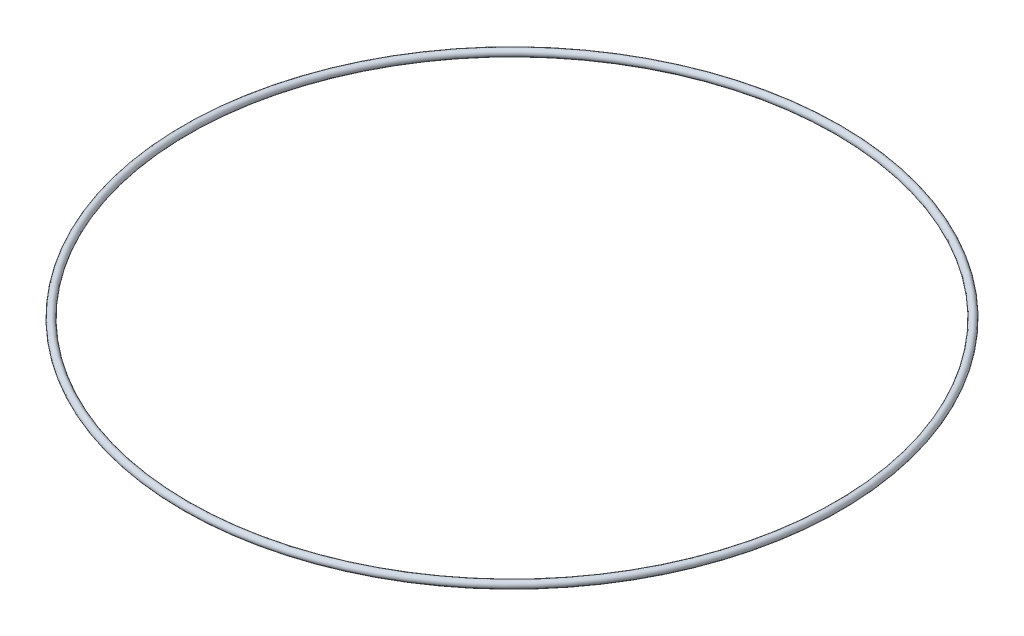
ISO-10303-21;
HEADER;
FILE_DESCRIPTION(('STEP AP214'),'2;1');
FILE_NAME('part.step','',(''),(''),'','','');
FILE_SCHEMA(('AUTOMOTIVE_DESIGN { 1 0 10303 214 1 1 1 1 }'));
ENDSEC;
DATA;
#1=APPLICATION_CONTEXT('core data for automotive mechanical design processes');
#2=APPLICATION_PROTOCOL_DEFINITION('international standard','automotive_design',2000,#1);
#3=PRODUCT_CONTEXT('',#1,'mechanical');
#4=PRODUCT('Part','Part','',(#3));
#5=PRODUCT_RELATED_PRODUCT_CATEGORY('part','',(#4));
#6=PRODUCT_DEFINITION_FORMATION('','',#4);
#7=PRODUCT_DEFINITION_CONTEXT('part definition',#1,'design');
#8=PRODUCT_DEFINITION('design','',#6,#7);
#9=PRODUCT_DEFINITION_SHAPE('','',#8);
#10=(LENGTH_UNIT() NAMED_UNIT(*) SI_UNIT(.MILLI.,.METRE.));
#11=(NAMED_UNIT(*) PLANE_ANGLE_UNIT() SI_UNIT($,.RADIAN.));
#12=(NAMED_UNIT(*) SI_UNIT($,.STERADIAN.) SOLID_ANGLE_UNIT());
#13=UNCERTAINTY_MEASURE_WITH_UNIT(LENGTH_MEASURE(1.E-05),#10,'distance_accuracy_value','');
#14=(GEOMETRIC_REPRESENTATION_CONTEXT(3) GLOBAL_UNCERTAINTY_ASSIGNED_CONTEXT((#13)) GLOBAL_UNIT_ASSIGNED_CONTEXT((#10,
#11,#12)) REPRESENTATION_CONTEXT('',''));
#15=CARTESIAN_POINT('',(0.,0.,0.));
#16=DIRECTION('',(0.,0.,1.));
#17=DIRECTION('',(1.,0.,0.));
#18=AXIS2_PLACEMENT_3D('',#15,#16,#17);
#19=CARTESIAN_POINT('',(0.,0.,0.));
#20=DIRECTION('',(0.,1.,0.));
#21=DIRECTION('',(0.,0.,1.));
#22=AXIS2_PLACEMENT_3D('',#19,#20,#21);
#23=TOROIDAL_SURFACE('',#22,136.5,1.5);
#24=CARTESIAN_POINT('',(0.,0.,138.));
#25=VERTEX_POINT('',#24);
#26=VERTEX_LOOP('',#25);
#27=FACE_BOUND('',#26,.T.);
#28=ADVANCED_FACE('F29',(#27),#23,.T.);
#29=CLOSED_SHELL('',(#28));
#30=MANIFOLD_SOLID_BREP('B2',#29);
#31=ADVANCED_BREP_SHAPE_REPRESENTATION('',(#18,#30),#14);
#32=SHAPE_DEFINITION_REPRESENTATION(#9,#31);
ENDSEC;
END-ISO-10303-21;
